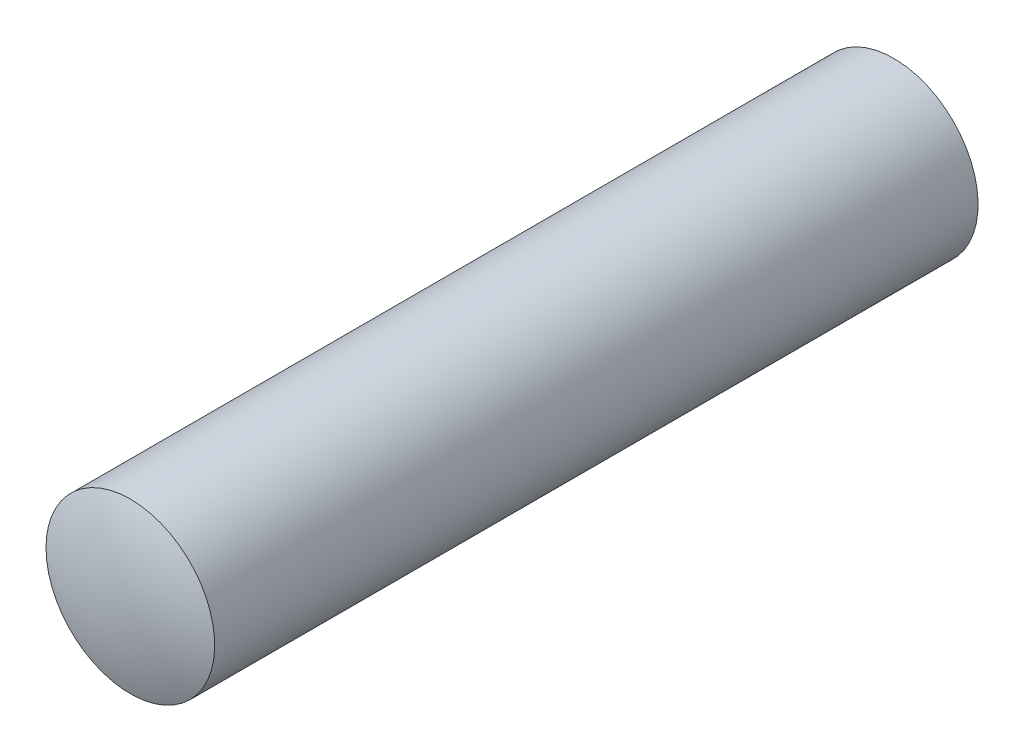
ISO-10303-21;
HEADER;
FILE_DESCRIPTION(('STEP AP214'),'2;1');
FILE_NAME('part.step','',(''),(''),'','','');
FILE_SCHEMA(('AUTOMOTIVE_DESIGN { 1 0 10303 214 1 1 1 1 }'));
ENDSEC;
DATA;
#1=APPLICATION_CONTEXT('core data for automotive mechanical design processes');
#2=APPLICATION_PROTOCOL_DEFINITION('international standard','automotive_design',2000,#1);
#3=PRODUCT_CONTEXT('',#1,'mechanical');
#4=PRODUCT('Part','Part','',(#3));
#5=PRODUCT_RELATED_PRODUCT_CATEGORY('part','',(#4));
#6=PRODUCT_DEFINITION_FORMATION('','',#4);
#7=PRODUCT_DEFINITION_CONTEXT('part definition',#1,'design');
#8=PRODUCT_DEFINITION('design','',#6,#7);
#9=PRODUCT_DEFINITION_SHAPE('','',#8);
#10=(LENGTH_UNIT() NAMED_UNIT(*) SI_UNIT(.MILLI.,.METRE.));
#11=(NAMED_UNIT(*) PLANE_ANGLE_UNIT() SI_UNIT($,.RADIAN.));
#12=(NAMED_UNIT(*) SI_UNIT($,.STERADIAN.) SOLID_ANGLE_UNIT());
#13=UNCERTAINTY_MEASURE_WITH_UNIT(LENGTH_MEASURE(1.E-05),#10,'distance_accuracy_value','');
#14=(GEOMETRIC_REPRESENTATION_CONTEXT(3) GLOBAL_UNCERTAINTY_ASSIGNED_CONTEXT((#13)) GLOBAL_UNIT_ASSIGNED_CONTEXT((#10,
#11,#12)) REPRESENTATION_CONTEXT('',''));
#15=CARTESIAN_POINT('',(0.,0.,0.));
#16=DIRECTION('',(0.,0.,1.));
#17=DIRECTION('',(1.,0.,0.));
#18=AXIS2_PLACEMENT_3D('',#15,#16,#17);
#19=CARTESIAN_POINT('',(0.,0.,-74.5));
#20=DIRECTION('',(0.,0.,1.));
#21=DIRECTION('',(1.,0.,0.));
#22=AXIS2_PLACEMENT_3D('',#19,#20,#21);
#23=CYLINDRICAL_SURFACE('',#22,7.9);
#24=CARTESIAN_POINT('',(0.,0.,-73.));
#25=DIRECTION('',(0.,0.,-1.));
#26=DIRECTION('',(-1.,0.,0.));
#27=AXIS2_PLACEMENT_3D('',#24,#25,#26);
#28=CIRCLE('',#27,7.89999999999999);
#29=CARTESIAN_POINT('',(-7.89999999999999,0.,-73.));
#30=VERTEX_POINT('',#29);
#31=EDGE_CURVE('E53',#30,#30,#28,.T.);
#32=ORIENTED_EDGE('',*,*,#31,.F.);
#33=EDGE_LOOP('',(#32));
#34=FACE_BOUND('',#33,.T.);
#35=CARTESIAN_POINT('',(0.,0.,-1.5));
#36=DIRECTION('',(0.,0.,-1.));
#37=DIRECTION('',(-1.,0.,0.));
#38=AXIS2_PLACEMENT_3D('',#35,#36,#37);
#39=CIRCLE('',#38,7.9);
#40=CARTESIAN_POINT('',(-7.9,0.,-1.5));
#41=VERTEX_POINT('',#40);
#42=EDGE_CURVE('E13',#41,#41,#39,.T.);
#43=ORIENTED_EDGE('',*,*,#42,.T.);
#44=EDGE_LOOP('',(#43));
#45=FACE_BOUND('',#44,.T.);
#46=ADVANCED_FACE('F46',(#34,#45),#23,.T.);
#47=CARTESIAN_POINT('',(0.,0.,-21.5533333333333));
#48=DIRECTION('',(0.,0.,-1.));
#49=DIRECTION('',(0.,1.,0.));
#50=AXIS2_PLACEMENT_3D('',#47,#48,#49);
#51=SPHERICAL_SURFACE('',#50,21.5533333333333);
#52=CARTESIAN_POINT('',(0.,0.,0.));
#53=VERTEX_POINT('',#52);
#54=VERTEX_LOOP('',#53);
#55=FACE_BOUND('',#54,.T.);
#56=ORIENTED_EDGE('',*,*,#42,.F.);
#57=EDGE_LOOP('',(#56));
#58=FACE_BOUND('',#57,.T.);
#59=ADVANCED_FACE('F62',(#55,#58),#51,.T.);
#60=CARTESIAN_POINT('',(0.,0.,-52.9466666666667));
#61=DIRECTION('',(0.,0.,-1.));
#62=DIRECTION('',(0.,-1.,0.));
#63=AXIS2_PLACEMENT_3D('',#60,#61,#62);
#64=SPHERICAL_SURFACE('',#63,21.5533333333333);
#65=CARTESIAN_POINT('',(0.,0.,-74.5));
#66=VERTEX_POINT('',#65);
#67=VERTEX_LOOP('',#66);
#68=FACE_BOUND('',#67,.T.);
#69=ORIENTED_EDGE('',*,*,#31,.T.);
#70=EDGE_LOOP('',(#69));
#71=FACE_BOUND('',#70,.T.);
#72=ADVANCED_FACE('F59',(#68,#71),#64,.T.);
#73=CLOSED_SHELL('',(#46,#59,#72));
#74=MANIFOLD_SOLID_BREP('B2',#73);
#75=ADVANCED_BREP_SHAPE_REPRESENTATION('',(#18,#74),#14);
#76=SHAPE_DEFINITION_REPRESENTATION(#9,#75);
ENDSEC;
END-ISO-10303-21;
